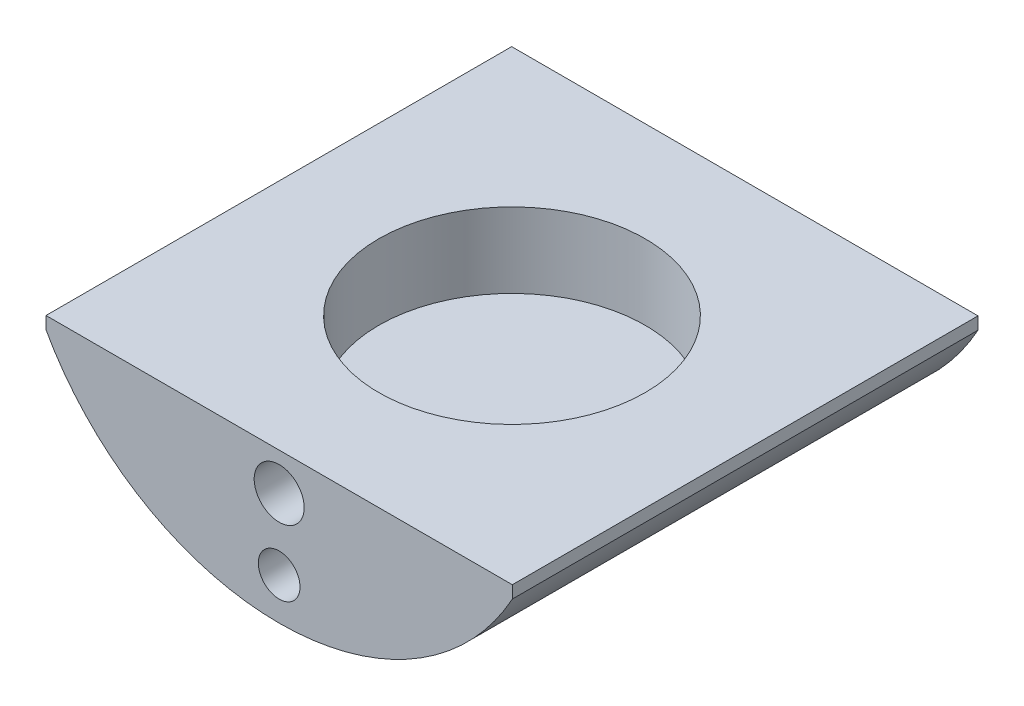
ISO-10303-21;
HEADER;
FILE_DESCRIPTION(('STEP AP214'),'2;1');
FILE_NAME('part.step','',(''),(''),'','','');
FILE_SCHEMA(('AUTOMOTIVE_DESIGN { 1 0 10303 214 1 1 1 1 }'));
ENDSEC;
DATA;
#1=APPLICATION_CONTEXT('core data for automotive mechanical design processes');
#2=APPLICATION_PROTOCOL_DEFINITION('international standard','automotive_design',2000,#1);
#3=PRODUCT_CONTEXT('',#1,'mechanical');
#4=PRODUCT('Part','Part','',(#3));
#5=PRODUCT_RELATED_PRODUCT_CATEGORY('part','',(#4));
#6=PRODUCT_DEFINITION_FORMATION('','',#4);
#7=PRODUCT_DEFINITION_CONTEXT('part definition',#1,'design');
#8=PRODUCT_DEFINITION('design','',#6,#7);
#9=PRODUCT_DEFINITION_SHAPE('','',#8);
#10=(LENGTH_UNIT() NAMED_UNIT(*) SI_UNIT(.MILLI.,.METRE.));
#11=(NAMED_UNIT(*) PLANE_ANGLE_UNIT() SI_UNIT($,.RADIAN.));
#12=(NAMED_UNIT(*) SI_UNIT($,.STERADIAN.) SOLID_ANGLE_UNIT());
#13=UNCERTAINTY_MEASURE_WITH_UNIT(LENGTH_MEASURE(1.E-05),#10,'distance_accuracy_value','');
#14=(GEOMETRIC_REPRESENTATION_CONTEXT(3) GLOBAL_UNCERTAINTY_ASSIGNED_CONTEXT((#13)) GLOBAL_UNIT_ASSIGNED_CONTEXT((#10,
#11,#12)) REPRESENTATION_CONTEXT('',''));
#15=CARTESIAN_POINT('',(0.,0.,0.));
#16=DIRECTION('',(0.,0.,1.));
#17=DIRECTION('',(1.,0.,0.));
#18=AXIS2_PLACEMENT_3D('',#15,#16,#17);
#19=CARTESIAN_POINT('',(0.,22.225,-44.3865));
#20=DIRECTION('',(0.,0.,1.));
#21=DIRECTION('',(1.,0.,0.));
#22=AXIS2_PLACEMENT_3D('',#19,#20,#21);
#23=PLANE('',#22);
#24=CARTESIAN_POINT('',(0.,-7.14375,-44.3865));
#25=DIRECTION('',(0.,0.,1.));
#26=DIRECTION('',(1.,0.,0.));
#27=AXIS2_PLACEMENT_3D('',#24,#25,#26);
#28=CIRCLE('',#27,4.7625);
#29=CARTESIAN_POINT('',(4.7625,-7.14375,-44.3865));
#30=VERTEX_POINT('',#29);
#31=EDGE_CURVE('E285',#30,#30,#28,.T.);
#32=ORIENTED_EDGE('',*,*,#31,.T.);
#33=EDGE_LOOP('',(#32));
#34=FACE_BOUND('',#33,.T.);
#35=DIRECTION('',(0.,-1.,0.));
#36=VECTOR('',#35,1.);
#37=CARTESIAN_POINT('',(-44.45,0.,-44.3865));
#38=LINE('',#37,#36);
#39=CARTESIAN_POINT('',(-44.45,0.,-44.3865));
#40=VERTEX_POINT('',#39);
#41=CARTESIAN_POINT('',(-44.45,-2.36844424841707,-44.3865));
#42=VERTEX_POINT('',#41);
#43=EDGE_CURVE('E103',#40,#42,#38,.T.);
#44=ORIENTED_EDGE('',*,*,#43,.F.);
#45=DIRECTION('',(1.,0.,0.));
#46=VECTOR('',#45,1.);
#47=CARTESIAN_POINT('',(-44.45,0.,-44.3865));
#48=LINE('',#47,#46);
#49=CARTESIAN_POINT('',(44.45,0.,-44.3865));
#50=VERTEX_POINT('',#49);
#51=EDGE_CURVE('E100',#40,#50,#48,.T.);
#52=ORIENTED_EDGE('',*,*,#51,.T.);
#53=DIRECTION('',(0.,1.,0.));
#54=VECTOR('',#53,1.);
#55=CARTESIAN_POINT('',(44.45,-2.3684442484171,-44.3865));
#56=LINE('',#55,#54);
#57=CARTESIAN_POINT('',(44.45,-2.3684442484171,-44.3865));
#58=VERTEX_POINT('',#57);
#59=EDGE_CURVE('E92',#58,#50,#56,.T.);
#60=ORIENTED_EDGE('',*,*,#59,.F.);
#61=CARTESIAN_POINT('',(0.,22.225,-44.3865));
#62=DIRECTION('',(0.,0.,1.));
#63=DIRECTION('',(1.,0.,0.));
#64=AXIS2_PLACEMENT_3D('',#61,#62,#63);
#65=CIRCLE('',#64,50.8);
#66=EDGE_CURVE('E99',#42,#58,#65,.T.);
#67=ORIENTED_EDGE('',*,*,#66,.F.);
#68=EDGE_LOOP('',(#44,#52,#60,#67));
#69=FACE_BOUND('',#68,.T.);
#70=CARTESIAN_POINT('',(0.,-20.6248,-44.3865000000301));
#71=DIRECTION('',(0.,0.,1.));
#72=DIRECTION('',(1.,0.,0.));
#73=AXIS2_PLACEMENT_3D('',#70,#71,#72);
#74=CIRCLE('',#73,3.9751);
#75=CARTESIAN_POINT('',(3.9751,-20.6248,-44.3865000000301));
#76=VERTEX_POINT('',#75);
#77=EDGE_CURVE('E286',#76,#76,#74,.T.);
#78=ORIENTED_EDGE('',*,*,#77,.T.);
#79=EDGE_LOOP('',(#78));
#80=FACE_BOUND('',#79,.T.);
#81=ADVANCED_FACE('F43',(#34,#69,#80),#23,.F.);
#82=CARTESIAN_POINT('',(-44.45,0.,-44.3865));
#83=DIRECTION('',(-1.,0.,0.));
#84=DIRECTION('',(0.,-1.,0.));
#85=AXIS2_PLACEMENT_3D('',#82,#83,#84);
#86=PLANE('',#85);
#87=DIRECTION('',(0.,-1.,0.));
#88=VECTOR('',#87,1.);
#89=CARTESIAN_POINT('',(-44.45,0.,44.3865));
#90=LINE('',#89,#88);
#91=CARTESIAN_POINT('',(-44.45,0.,44.3865));
#92=VERTEX_POINT('',#91);
#93=CARTESIAN_POINT('',(-44.45,-2.36844424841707,44.3865));
#94=VERTEX_POINT('',#93);
#95=EDGE_CURVE('E110',#92,#94,#90,.T.);
#96=ORIENTED_EDGE('',*,*,#95,.F.);
#97=DIRECTION('',(0.,0.,1.));
#98=VECTOR('',#97,1.);
#99=CARTESIAN_POINT('',(-44.45,0.,-44.3865));
#100=LINE('',#99,#98);
#101=EDGE_CURVE('E11',#40,#92,#100,.T.);
#102=ORIENTED_EDGE('',*,*,#101,.F.);
#103=ORIENTED_EDGE('',*,*,#43,.T.);
#104=DIRECTION('',(0.,0.,1.));
#105=VECTOR('',#104,1.);
#106=CARTESIAN_POINT('',(-44.45,-2.36844424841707,-44.3865));
#107=LINE('',#106,#105);
#108=EDGE_CURVE('E47',#42,#94,#107,.T.);
#109=ORIENTED_EDGE('',*,*,#108,.T.);
#110=EDGE_LOOP('',(#96,#102,#103,#109));
#111=FACE_BOUND('',#110,.T.);
#112=ADVANCED_FACE('F45',(#111),#86,.T.);
#113=CARTESIAN_POINT('',(-44.45,0.,-44.3865));
#114=DIRECTION('',(0.,-1.,0.));
#115=DIRECTION('',(1.,0.,0.));
#116=AXIS2_PLACEMENT_3D('',#113,#114,#115);
#117=PLANE('',#116);
#118=CARTESIAN_POINT('',(0.,0.,0.));
#119=DIRECTION('',(0.,1.,0.));
#120=DIRECTION('',(-1.,0.,0.));
#121=AXIS2_PLACEMENT_3D('',#118,#119,#120);
#122=CIRCLE('',#121,25.4);
#123=CARTESIAN_POINT('',(-25.4,0.,0.));
#124=VERTEX_POINT('',#123);
#125=EDGE_CURVE('E305',#124,#124,#122,.T.);
#126=ORIENTED_EDGE('',*,*,#125,.F.);
#127=EDGE_LOOP('',(#126));
#128=FACE_BOUND('',#127,.T.);
#129=DIRECTION('',(1.,0.,0.));
#130=VECTOR('',#129,1.);
#131=CARTESIAN_POINT('',(-44.45,0.,44.3865));
#132=LINE('',#131,#130);
#133=CARTESIAN_POINT('',(44.45,0.,44.3865));
#134=VERTEX_POINT('',#133);
#135=EDGE_CURVE('E105',#92,#134,#132,.T.);
#136=ORIENTED_EDGE('',*,*,#135,.T.);
#137=DIRECTION('',(0.,0.,1.));
#138=VECTOR('',#137,1.);
#139=CARTESIAN_POINT('',(44.45,0.,-44.3865));
#140=LINE('',#139,#138);
#141=EDGE_CURVE('E53',#50,#134,#140,.T.);
#142=ORIENTED_EDGE('',*,*,#141,.F.);
#143=ORIENTED_EDGE('',*,*,#51,.F.);
#144=ORIENTED_EDGE('',*,*,#101,.T.);
#145=EDGE_LOOP('',(#136,#142,#143,#144));
#146=FACE_BOUND('',#145,.T.);
#147=ADVANCED_FACE('F118',(#128,#146),#117,.F.);
#148=CARTESIAN_POINT('',(44.45,-2.3684442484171,-44.3865));
#149=DIRECTION('',(1.,0.,0.));
#150=DIRECTION('',(0.,1.,0.));
#151=AXIS2_PLACEMENT_3D('',#148,#149,#150);
#152=PLANE('',#151);
#153=DIRECTION('',(0.,1.,0.));
#154=VECTOR('',#153,1.);
#155=CARTESIAN_POINT('',(44.45,-2.3684442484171,44.3865));
#156=LINE('',#155,#154);
#157=CARTESIAN_POINT('',(44.45,-2.3684442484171,44.3865));
#158=VERTEX_POINT('',#157);
#159=EDGE_CURVE('E94',#158,#134,#156,.T.);
#160=ORIENTED_EDGE('',*,*,#159,.F.);
#161=DIRECTION('',(0.,0.,1.));
#162=VECTOR('',#161,1.);
#163=CARTESIAN_POINT('',(44.45,-2.3684442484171,-44.3865));
#164=LINE('',#163,#162);
#165=EDGE_CURVE('E89',#58,#158,#164,.T.);
#166=ORIENTED_EDGE('',*,*,#165,.F.);
#167=ORIENTED_EDGE('',*,*,#59,.T.);
#168=ORIENTED_EDGE('',*,*,#141,.T.);
#169=EDGE_LOOP('',(#160,#166,#167,#168));
#170=FACE_BOUND('',#169,.T.);
#171=ADVANCED_FACE('F91',(#170),#152,.T.);
#172=CARTESIAN_POINT('',(0.,22.225,-44.3865));
#173=DIRECTION('',(0.,0.,1.));
#174=DIRECTION('',(1.,0.,0.));
#175=AXIS2_PLACEMENT_3D('',#172,#173,#174);
#176=CYLINDRICAL_SURFACE('',#175,50.8);
#177=CARTESIAN_POINT('',(0.,22.225,44.3865));
#178=DIRECTION('',(0.,0.,1.));
#179=DIRECTION('',(1.,0.,0.));
#180=AXIS2_PLACEMENT_3D('',#177,#178,#179);
#181=CIRCLE('',#180,50.8);
#182=EDGE_CURVE('E113',#94,#158,#181,.T.);
#183=ORIENTED_EDGE('',*,*,#182,.F.);
#184=ORIENTED_EDGE('',*,*,#108,.F.);
#185=ORIENTED_EDGE('',*,*,#66,.T.);
#186=ORIENTED_EDGE('',*,*,#165,.T.);
#187=EDGE_LOOP('',(#183,#184,#185,#186));
#188=FACE_BOUND('',#187,.T.);
#189=ADVANCED_FACE('F102',(#188),#176,.T.);
#190=CARTESIAN_POINT('',(0.,22.225,44.3865));
#191=DIRECTION('',(0.,0.,1.));
#192=DIRECTION('',(1.,0.,0.));
#193=AXIS2_PLACEMENT_3D('',#190,#191,#192);
#194=PLANE('',#193);
#195=CARTESIAN_POINT('',(0.,-20.6248,44.3865000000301));
#196=DIRECTION('',(0.,0.,1.));
#197=DIRECTION('',(1.,0.,0.));
#198=AXIS2_PLACEMENT_3D('',#195,#196,#197);
#199=CIRCLE('',#198,3.9751);
#200=CARTESIAN_POINT('',(3.9751,-20.6248,44.3865000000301));
#201=VERTEX_POINT('',#200);
#202=EDGE_CURVE('E294',#201,#201,#199,.T.);
#203=ORIENTED_EDGE('',*,*,#202,.F.);
#204=EDGE_LOOP('',(#203));
#205=FACE_BOUND('',#204,.T.);
#206=CARTESIAN_POINT('',(0.,-7.14375,44.3865));
#207=DIRECTION('',(0.,0.,1.));
#208=DIRECTION('',(1.,0.,0.));
#209=AXIS2_PLACEMENT_3D('',#206,#207,#208);
#210=CIRCLE('',#209,4.7625);
#211=CARTESIAN_POINT('',(4.7625,-7.14375,44.3865));
#212=VERTEX_POINT('',#211);
#213=EDGE_CURVE('E299',#212,#212,#210,.T.);
#214=ORIENTED_EDGE('',*,*,#213,.F.);
#215=EDGE_LOOP('',(#214));
#216=FACE_BOUND('',#215,.T.);
#217=ORIENTED_EDGE('',*,*,#95,.T.);
#218=ORIENTED_EDGE('',*,*,#182,.T.);
#219=ORIENTED_EDGE('',*,*,#159,.T.);
#220=ORIENTED_EDGE('',*,*,#135,.F.);
#221=EDGE_LOOP('',(#217,#218,#219,#220));
#222=FACE_BOUND('',#221,.T.);
#223=ADVANCED_FACE('F120',(#205,#216,#222),#194,.T.);
#224=CARTESIAN_POINT('',(0.,-14.2875,0.));
#225=DIRECTION('',(0.,1.,0.));
#226=DIRECTION('',(-1.,0.,0.));
#227=AXIS2_PLACEMENT_3D('',#224,#225,#226);
#228=CYLINDRICAL_SURFACE('',#227,25.4);
#229=CARTESIAN_POINT('',(0.,-14.2875,0.));
#230=DIRECTION('',(0.,1.,0.));
#231=DIRECTION('',(-1.,0.,0.));
#232=AXIS2_PLACEMENT_3D('',#229,#230,#231);
#233=CIRCLE('',#232,25.4);
#234=CARTESIAN_POINT('',(-25.4,-14.2875,0.));
#235=VERTEX_POINT('',#234);
#236=EDGE_CURVE('E114',#235,#235,#233,.T.);
#237=ORIENTED_EDGE('',*,*,#236,.F.);
#238=EDGE_LOOP('',(#237));
#239=FACE_BOUND('',#238,.T.);
#240=ORIENTED_EDGE('',*,*,#125,.T.);
#241=EDGE_LOOP('',(#240));
#242=FACE_BOUND('',#241,.T.);
#243=ADVANCED_FACE('F136',(#239,#242),#228,.F.);
#244=CARTESIAN_POINT('',(0.,-14.2875,0.));
#245=DIRECTION('',(0.,1.,0.));
#246=DIRECTION('',(-1.,0.,0.));
#247=AXIS2_PLACEMENT_3D('',#244,#245,#246);
#248=PLANE('',#247);
#249=ORIENTED_EDGE('',*,*,#236,.T.);
#250=EDGE_LOOP('',(#249));
#251=FACE_BOUND('',#250,.T.);
#252=ADVANCED_FACE('F154',(#251),#248,.T.);
#253=CARTESIAN_POINT('',(0.,-7.14375,30.099));
#254=DIRECTION('',(0.,0.,1.));
#255=DIRECTION('',(1.,0.,0.));
#256=AXIS2_PLACEMENT_3D('',#253,#254,#255);
#257=CYLINDRICAL_SURFACE('',#256,4.7625);
#258=CARTESIAN_POINT('',(0.,-7.14375,30.099));
#259=DIRECTION('',(0.,0.,1.));
#260=DIRECTION('',(1.,0.,0.));
#261=AXIS2_PLACEMENT_3D('',#258,#259,#260);
#262=CIRCLE('',#261,4.7625);
#263=CARTESIAN_POINT('',(4.7625,-7.14375,30.099));
#264=VERTEX_POINT('',#263);
#265=EDGE_CURVE('E302',#264,#264,#262,.T.);
#266=ORIENTED_EDGE('',*,*,#265,.F.);
#267=EDGE_LOOP('',(#266));
#268=FACE_BOUND('',#267,.T.);
#269=ORIENTED_EDGE('',*,*,#213,.T.);
#270=EDGE_LOOP('',(#269));
#271=FACE_BOUND('',#270,.T.);
#272=ADVANCED_FACE('F150',(#268,#271),#257,.F.);
#273=CARTESIAN_POINT('',(0.,-7.14375,30.099));
#274=DIRECTION('',(0.,0.,1.));
#275=DIRECTION('',(1.,0.,0.));
#276=AXIS2_PLACEMENT_3D('',#273,#274,#275);
#277=PLANE('',#276);
#278=ORIENTED_EDGE('',*,*,#265,.T.);
#279=EDGE_LOOP('',(#278));
#280=FACE_BOUND('',#279,.T.);
#281=ADVANCED_FACE('F153',(#280),#277,.T.);
#282=CARTESIAN_POINT('',(0.,-20.6248,26.9240000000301));
#283=DIRECTION('',(0.,0.,1.));
#284=DIRECTION('',(1.,0.,0.));
#285=AXIS2_PLACEMENT_3D('',#282,#283,#284);
#286=CYLINDRICAL_SURFACE('',#285,3.9751);
#287=CARTESIAN_POINT('',(0.,-20.6248,26.9240000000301));
#288=DIRECTION('',(0.,0.,1.));
#289=DIRECTION('',(1.,0.,0.));
#290=AXIS2_PLACEMENT_3D('',#287,#288,#289);
#291=CIRCLE('',#290,3.9751);
#292=CARTESIAN_POINT('',(3.9751,-20.6248,26.9240000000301));
#293=VERTEX_POINT('',#292);
#294=EDGE_CURVE('E296',#293,#293,#291,.T.);
#295=ORIENTED_EDGE('',*,*,#294,.F.);
#296=EDGE_LOOP('',(#295));
#297=FACE_BOUND('',#296,.T.);
#298=ORIENTED_EDGE('',*,*,#202,.T.);
#299=EDGE_LOOP('',(#298));
#300=FACE_BOUND('',#299,.T.);
#301=ADVANCED_FACE('F160',(#297,#300),#286,.F.);
#302=CARTESIAN_POINT('',(0.,-20.6248,26.9240000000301));
#303=DIRECTION('',(0.,0.,1.));
#304=DIRECTION('',(1.,0.,0.));
#305=AXIS2_PLACEMENT_3D('',#302,#303,#304);
#306=PLANE('',#305);
#307=ORIENTED_EDGE('',*,*,#294,.T.);
#308=EDGE_LOOP('',(#307));
#309=FACE_BOUND('',#308,.T.);
#310=ADVANCED_FACE('F163',(#309),#306,.T.);
#311=CARTESIAN_POINT('',(0.,-7.14375,-30.099));
#312=DIRECTION('',(0.,0.,-1.));
#313=DIRECTION('',(-1.,0.,0.));
#314=AXIS2_PLACEMENT_3D('',#311,#312,#313);
#315=CYLINDRICAL_SURFACE('',#314,4.7625);
#316=CARTESIAN_POINT('',(0.,-7.14375,-30.099));
#317=DIRECTION('',(0.,0.,1.));
#318=DIRECTION('',(1.,0.,0.));
#319=AXIS2_PLACEMENT_3D('',#316,#317,#318);
#320=CIRCLE('',#319,4.7625);
#321=CARTESIAN_POINT('',(4.7625,-7.14375,-30.099));
#322=VERTEX_POINT('',#321);
#323=EDGE_CURVE('E288',#322,#322,#320,.T.);
#324=ORIENTED_EDGE('',*,*,#323,.T.);
#325=EDGE_LOOP('',(#324));
#326=FACE_BOUND('',#325,.T.);
#327=ORIENTED_EDGE('',*,*,#31,.F.);
#328=EDGE_LOOP('',(#327));
#329=FACE_BOUND('',#328,.T.);
#330=ADVANCED_FACE('F169',(#326,#329),#315,.F.);
#331=CARTESIAN_POINT('',(0.,-7.14375,-30.099));
#332=DIRECTION('',(0.,0.,-1.));
#333=DIRECTION('',(1.,0.,0.));
#334=AXIS2_PLACEMENT_3D('',#331,#332,#333);
#335=PLANE('',#334);
#336=ORIENTED_EDGE('',*,*,#323,.F.);
#337=EDGE_LOOP('',(#336));
#338=FACE_BOUND('',#337,.T.);
#339=ADVANCED_FACE('F172',(#338),#335,.T.);
#340=CARTESIAN_POINT('',(0.,-20.6248,-26.9240000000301));
#341=DIRECTION('',(0.,0.,-1.));
#342=DIRECTION('',(-1.,0.,0.));
#343=AXIS2_PLACEMENT_3D('',#340,#341,#342);
#344=CYLINDRICAL_SURFACE('',#343,3.9751);
#345=CARTESIAN_POINT('',(0.,-20.6248,-26.9240000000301));
#346=DIRECTION('',(0.,0.,1.));
#347=DIRECTION('',(1.,0.,0.));
#348=AXIS2_PLACEMENT_3D('',#345,#346,#347);
#349=CIRCLE('',#348,3.9751);
#350=CARTESIAN_POINT('',(3.9751,-20.6248,-26.9240000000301));
#351=VERTEX_POINT('',#350);
#352=EDGE_CURVE('E284',#351,#351,#349,.T.);
#353=ORIENTED_EDGE('',*,*,#352,.T.);
#354=EDGE_LOOP('',(#353));
#355=FACE_BOUND('',#354,.T.);
#356=ORIENTED_EDGE('',*,*,#77,.F.);
#357=EDGE_LOOP('',(#356));
#358=FACE_BOUND('',#357,.T.);
#359=ADVANCED_FACE('F178',(#355,#358),#344,.F.);
#360=CARTESIAN_POINT('',(0.,-20.6248,-26.9240000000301));
#361=DIRECTION('',(0.,0.,-1.));
#362=DIRECTION('',(1.,0.,0.));
#363=AXIS2_PLACEMENT_3D('',#360,#361,#362);
#364=PLANE('',#363);
#365=ORIENTED_EDGE('',*,*,#352,.F.);
#366=EDGE_LOOP('',(#365));
#367=FACE_BOUND('',#366,.T.);
#368=ADVANCED_FACE('F180',(#367),#364,.T.);
#369=CLOSED_SHELL('',(#81,#112,#147,#171,#189,#223,#243,#252,#272,#281,#301,#310,#330,#339,#359,#368));
#370=MANIFOLD_SOLID_BREP('B2',#369);
#371=ADVANCED_BREP_SHAPE_REPRESENTATION('',(#18,#370),#14);
#372=SHAPE_DEFINITION_REPRESENTATION(#9,#371);
ENDSEC;
END-ISO-10303-21;
